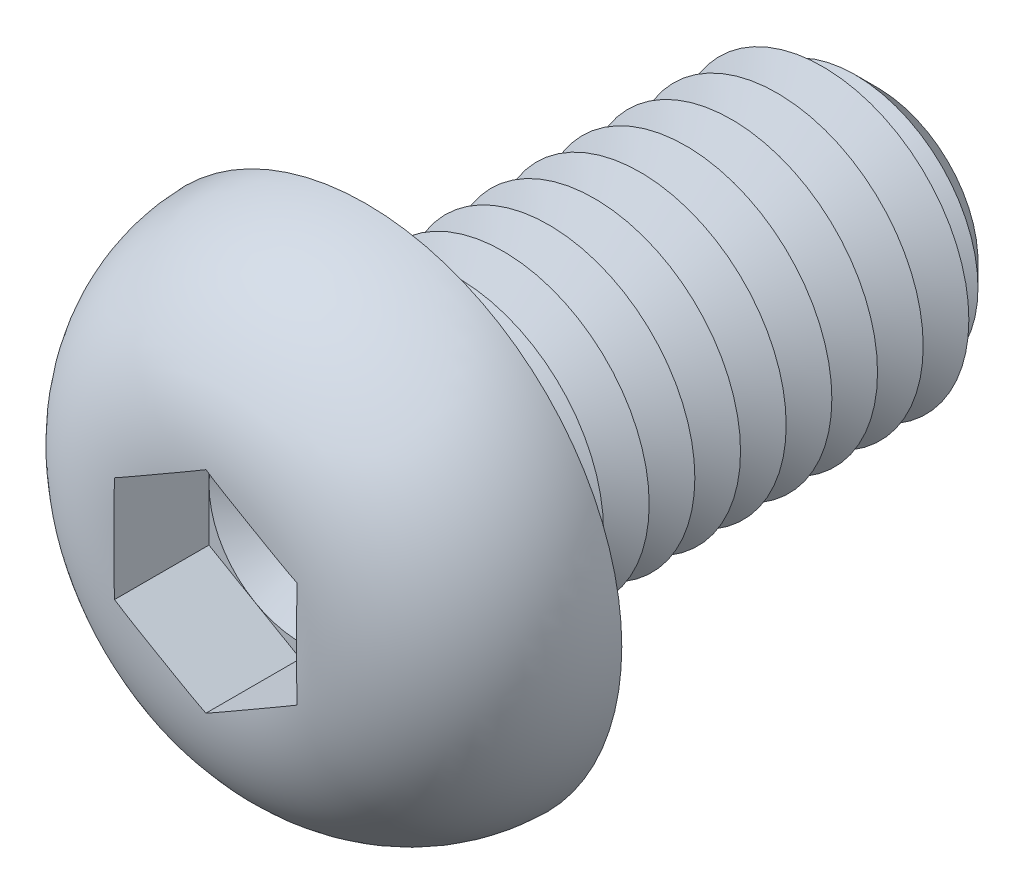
from build123d import *

# Parameters (mm, degrees)
CUT_EXTRUDE1_DEPTH  = 2.6
SKETCH4_R           = 4
BOSS_EXTRUDE1_DEPTH = 14
CHAMFER1_SIZE       = 1.25
LPATTERN1_COUNT     = 10
LPATTERN1_PITCH     = 1.25
FILLET2_R           = 0.5


with BuildPart() as part:
    # Sketch2 → Revolve1 (revolve)
    with BuildSketch(Plane(origin=(0, 0, 0), x_dir=(0, 0, -1), z_dir=(1, 0, 0)), mode=Mode.PRIVATE) as revolve1_sk:
        with BuildLine():
            Line((0, 0), (-4.4, 0))
            Line((-4.4, 0), (-4.4, 2.501111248))
            ThreePointArc((-4.4, 2.501111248), (-3.117141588, 5.647537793), (0, 7))
            Line((0, 7), (0, 0))
        make_face()
    revolve(revolve1_sk.sketch.rotate(Axis((0, 0, 47.934239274), (0, 0, -1)), 90), axis=Axis((0, 0, 47.934239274), (0, 0, -1)))

    # Sketch3 → Cut-Extrude1 (cut)
    with BuildSketch(Plane.XY.offset(4.4)):
        Polygon((0, 2.886751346), (-2.5, 1.443375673), (-2.5, -1.443375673), (0, -2.886751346), (2.5, -1.443375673), (2.5, 1.443375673), align=None)
    extrude(amount=-CUT_EXTRUDE1_DEPTH, mode=Mode.SUBTRACT)

    # Sketch4 → Boss-Extrude1 (add)
    with BuildSketch(Plane(origin=(0, 0, 0), x_dir=(-1, 0, 0), z_dir=(0, 0, -1))):
        with Locations(Location((0, 0, 0), (0, 0, 180))):
            Circle(SKETCH4_R)
    extrude(amount=BOSS_EXTRUDE1_DEPTH)

    # Chamfer1
    chamfer1_edges = [part.edges().sort_by_distance(p)[0] for p in [
        (-4, 0, -14),
    ]]
    chamfer(chamfer1_edges, length=CHAMFER1_SIZE)

    # Sketch5 → Cut-Revolve1 (revolve, cut)
    with BuildSketch(Plane(origin=(0, 0, 0), x_dir=(0, 0, -1), z_dir=(1, 0, 0)), mode=Mode.PRIVATE) as cut_revolve1_sk:
        Polygon((1.25, 4), (2.5, 4), (1.875, 2.917468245), align=None)
    cut_revolve1 = revolve(cut_revolve1_sk.sketch.rotate(Axis((0, 0, 47.934239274), (0, 0, -1)), 90), axis=Axis((0, 0, 47.934239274), (0, 0, -1)), mode=Mode.SUBTRACT)

    # LPattern1: Cut-Revolve1 ×10
    with Locations(*[(0, 0, -i * LPATTERN1_PITCH) for i in range(1, LPATTERN1_COUNT)]):
        add(cut_revolve1, mode=Mode.SUBTRACT)

    # Fillet2
    fillet2_edges = [part.edges().sort_by_distance(p)[0] for p in [
        (-4, 0, 0),
    ]]
    fillet(fillet2_edges, radius=FILLET2_R)

    # Cut-Extrude2 cone 1 section (on through the dimple's axis) → Cut-Extrude2 (revolve, cut)
    with BuildSketch(Plane(origin=(0, 0, 1.8), x_dir=(0, -1, 0), z_dir=(1, 0, 0))):
        Polygon((0, 0), (2.5, 0), (0, 1.443375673), align=None)
    revolve(axis=Axis((0, 0, 1.8), (0, 0, -1)), mode=Mode.SUBTRACT)


solid = part.part
